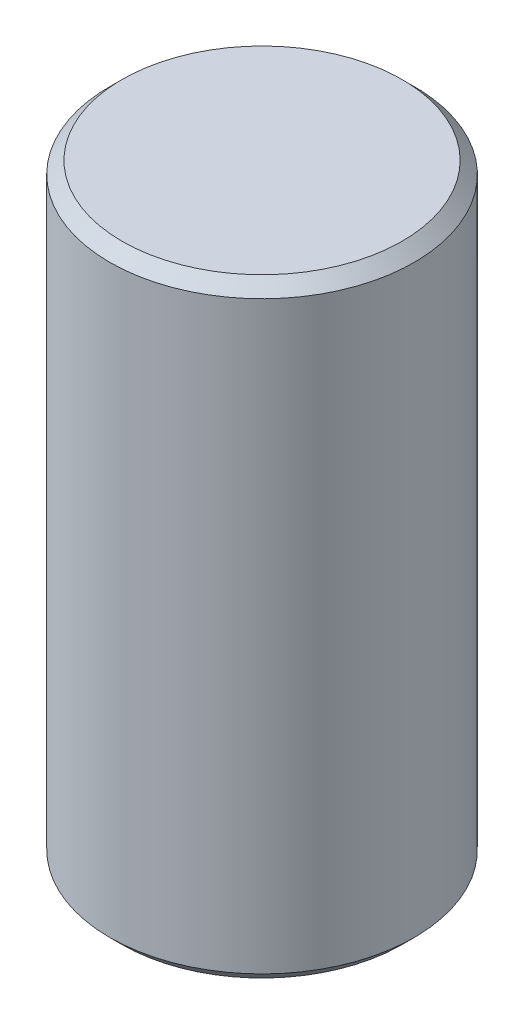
from build123d import *

# Parameters (mm, degrees)
SKETCH1_R           = 1.25
BOSS_EXTRUDE1_DEPTH = 5
CHAMFER1_SIZE       = 0.1


with BuildPart() as part:
    # Sketch1 → Boss-Extrude1 (new body)
    with BuildSketch(Plane(origin=(0, 0, 0), x_dir=(1, 0, 0), z_dir=(0, 1, 0))):
        with Locations(Location((0, 0, 0), (0, 0, 270))):
            Circle(SKETCH1_R)
    extrude(amount=BOSS_EXTRUDE1_DEPTH)

    # Chamfer1
    chamfer1_edges = [part.edges().sort_by_distance(p)[0] for p in [
        (0, 0, -1.25),
        (0, 5, -1.25),
    ]]
    chamfer(chamfer1_edges, length=CHAMFER1_SIZE)


solid = part.part
